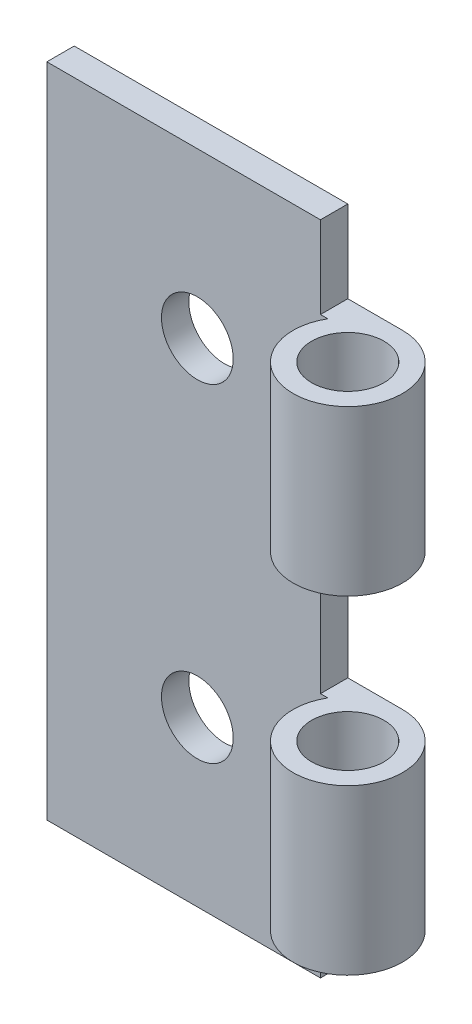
ISO-10303-21;
HEADER;
FILE_DESCRIPTION(('STEP AP214'),'2;1');
FILE_NAME('part.step','',(''),(''),'','','');
FILE_SCHEMA(('AUTOMOTIVE_DESIGN { 1 0 10303 214 1 1 1 1 }'));
ENDSEC;
DATA;
#1=APPLICATION_CONTEXT('core data for automotive mechanical design processes');
#2=APPLICATION_PROTOCOL_DEFINITION('international standard','automotive_design',2000,#1);
#3=PRODUCT_CONTEXT('',#1,'mechanical');
#4=PRODUCT('Part','Part','',(#3));
#5=PRODUCT_RELATED_PRODUCT_CATEGORY('part','',(#4));
#6=PRODUCT_DEFINITION_FORMATION('','',#4);
#7=PRODUCT_DEFINITION_CONTEXT('part definition',#1,'design');
#8=PRODUCT_DEFINITION('design','',#6,#7);
#9=PRODUCT_DEFINITION_SHAPE('','',#8);
#10=(LENGTH_UNIT() NAMED_UNIT(*) SI_UNIT(.MILLI.,.METRE.));
#11=(NAMED_UNIT(*) PLANE_ANGLE_UNIT() SI_UNIT($,.RADIAN.));
#12=(NAMED_UNIT(*) SI_UNIT($,.STERADIAN.) SOLID_ANGLE_UNIT());
#13=UNCERTAINTY_MEASURE_WITH_UNIT(LENGTH_MEASURE(1.E-05),#10,'distance_accuracy_value','');
#14=(GEOMETRIC_REPRESENTATION_CONTEXT(3) GLOBAL_UNCERTAINTY_ASSIGNED_CONTEXT((#13)) GLOBAL_UNIT_ASSIGNED_CONTEXT((#10,
#11,#12)) REPRESENTATION_CONTEXT('',''));
#15=CARTESIAN_POINT('',(0.,0.,0.));
#16=DIRECTION('',(0.,0.,1.));
#17=DIRECTION('',(1.,0.,0.));
#18=AXIS2_PLACEMENT_3D('',#15,#16,#17);
#19=CARTESIAN_POINT('',(0.,76.2,-3.175));
#20=DIRECTION('',(0.,0.,1.));
#21=DIRECTION('',(1.,0.,0.));
#22=AXIS2_PLACEMENT_3D('',#19,#20,#21);
#23=PLANE('',#22);
#24=CARTESIAN_POINT('',(-20.6375,19.05,-3.175));
#25=DIRECTION('',(0.,0.,1.));
#26=DIRECTION('',(1.,0.,0.));
#27=AXIS2_PLACEMENT_3D('',#24,#25,#26);
#28=CIRCLE('',#27,4.1656);
#29=CARTESIAN_POINT('',(-16.4719,19.05,-3.175));
#30=VERTEX_POINT('',#29);
#31=EDGE_CURVE('E194',#30,#30,#28,.T.);
#32=ORIENTED_EDGE('',*,*,#31,.T.);
#33=EDGE_LOOP('',(#32));
#34=FACE_BOUND('',#33,.T.);
#35=CARTESIAN_POINT('',(-20.6375,57.15,-3.175));
#36=DIRECTION('',(0.,0.,1.));
#37=DIRECTION('',(1.,0.,0.));
#38=AXIS2_PLACEMENT_3D('',#35,#36,#37);
#39=CIRCLE('',#38,4.1656);
#40=CARTESIAN_POINT('',(-16.4719,57.15,-3.175));
#41=VERTEX_POINT('',#40);
#42=EDGE_CURVE('E200',#41,#41,#39,.T.);
#43=ORIENTED_EDGE('',*,*,#42,.T.);
#44=EDGE_LOOP('',(#43));
#45=FACE_BOUND('',#44,.T.);
#46=DIRECTION('',(1.,0.,0.));
#47=VECTOR('',#46,1.);
#48=CARTESIAN_POINT('',(0.,47.625,-3.175));
#49=LINE('',#48,#47);
#50=CARTESIAN_POINT('',(-6.35000000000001,47.625,-3.175));
#51=VERTEX_POINT('',#50);
#52=CARTESIAN_POINT('',(0.,47.625,-3.175));
#53=VERTEX_POINT('',#52);
#54=EDGE_CURVE('E134',#51,#53,#49,.T.);
#55=ORIENTED_EDGE('',*,*,#54,.F.);
#56=DIRECTION('',(0.,1.,0.));
#57=VECTOR('',#56,1.);
#58=CARTESIAN_POINT('',(-6.35000000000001,76.2,-3.175));
#59=LINE('',#58,#57);
#60=CARTESIAN_POINT('',(-6.35000000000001,28.575,-3.175));
#61=VERTEX_POINT('',#60);
#62=EDGE_CURVE('E133',#61,#51,#59,.T.);
#63=ORIENTED_EDGE('',*,*,#62,.F.);
#64=DIRECTION('',(-1.,0.,0.));
#65=VECTOR('',#64,1.);
#66=CARTESIAN_POINT('',(0.,28.575,-3.175));
#67=LINE('',#66,#65);
#68=CARTESIAN_POINT('',(0.,28.575,-3.175));
#69=VERTEX_POINT('',#68);
#70=EDGE_CURVE('E141',#69,#61,#67,.T.);
#71=ORIENTED_EDGE('',*,*,#70,.F.);
#72=DIRECTION('',(0.,1.,0.));
#73=VECTOR('',#72,1.);
#74=CARTESIAN_POINT('',(0.,0.,-3.175));
#75=LINE('',#74,#73);
#76=CARTESIAN_POINT('',(0.,9.52499999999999,-3.175));
#77=VERTEX_POINT('',#76);
#78=EDGE_CURVE('E211',#77,#69,#75,.T.);
#79=ORIENTED_EDGE('',*,*,#78,.F.);
#80=DIRECTION('',(-1.,0.,0.));
#81=VECTOR('',#80,1.);
#82=CARTESIAN_POINT('',(0.,9.52499999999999,-3.175));
#83=LINE('',#82,#81);
#84=CARTESIAN_POINT('',(-6.35000000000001,9.52499999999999,-3.175));
#85=VERTEX_POINT('',#84);
#86=EDGE_CURVE('E45',#77,#85,#83,.T.);
#87=ORIENTED_EDGE('',*,*,#86,.T.);
#88=DIRECTION('',(0.,-1.,0.));
#89=VECTOR('',#88,1.);
#90=CARTESIAN_POINT('',(-6.3499999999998,76.2,-3.175));
#91=LINE('',#90,#89);
#92=CARTESIAN_POINT('',(-6.35000000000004,0.,-3.175));
#93=VERTEX_POINT('',#92);
#94=EDGE_CURVE('E163',#85,#93,#91,.T.);
#95=ORIENTED_EDGE('',*,*,#94,.T.);
#96=DIRECTION('',(1.,0.,0.));
#97=VECTOR('',#96,1.);
#98=CARTESIAN_POINT('',(0.,0.,-3.175));
#99=LINE('',#98,#97);
#100=CARTESIAN_POINT('',(-38.1,0.,-3.175));
#101=VERTEX_POINT('',#100);
#102=EDGE_CURVE('E219',#101,#93,#99,.T.);
#103=ORIENTED_EDGE('',*,*,#102,.F.);
#104=DIRECTION('',(0.,-1.,0.));
#105=VECTOR('',#104,1.);
#106=CARTESIAN_POINT('',(-38.1,0.,-3.175));
#107=LINE('',#106,#105);
#108=CARTESIAN_POINT('',(-38.1,76.2,-3.175));
#109=VERTEX_POINT('',#108);
#110=EDGE_CURVE('E216',#109,#101,#107,.T.);
#111=ORIENTED_EDGE('',*,*,#110,.F.);
#112=DIRECTION('',(-1.,0.,0.));
#113=VECTOR('',#112,1.);
#114=CARTESIAN_POINT('',(0.,76.2,-3.175));
#115=LINE('',#114,#113);
#116=CARTESIAN_POINT('',(-6.34999999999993,76.2,-3.175));
#117=VERTEX_POINT('',#116);
#118=EDGE_CURVE('E214',#117,#109,#115,.T.);
#119=ORIENTED_EDGE('',*,*,#118,.F.);
#120=DIRECTION('',(0.,1.,0.));
#121=VECTOR('',#120,1.);
#122=CARTESIAN_POINT('',(-6.34999999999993,76.2000000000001,-3.175));
#123=LINE('',#122,#121);
#124=CARTESIAN_POINT('',(-6.35000000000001,66.675,-3.175));
#125=VERTEX_POINT('',#124);
#126=EDGE_CURVE('E189',#125,#117,#123,.T.);
#127=ORIENTED_EDGE('',*,*,#126,.F.);
#128=DIRECTION('',(-1.,0.,0.));
#129=VECTOR('',#128,1.);
#130=CARTESIAN_POINT('',(0.,66.675,-3.175));
#131=LINE('',#130,#129);
#132=CARTESIAN_POINT('',(0.,66.675,-3.175));
#133=VERTEX_POINT('',#132);
#134=EDGE_CURVE('E184',#133,#125,#131,.T.);
#135=ORIENTED_EDGE('',*,*,#134,.F.);
#136=EDGE_CURVE('E210',#53,#133,#75,.T.);
#137=ORIENTED_EDGE('',*,*,#136,.F.);
#138=EDGE_LOOP('',(#55,#63,#71,#79,#87,#95,#103,#111,#119,#127,#135,#137));
#139=FACE_BOUND('',#138,.T.);
#140=ADVANCED_FACE('F30',(#34,#45,#139),#23,.F.);
#141=CARTESIAN_POINT('',(0.,76.2,0.));
#142=DIRECTION('',(0.,0.,1.));
#143=DIRECTION('',(1.,0.,0.));
#144=AXIS2_PLACEMENT_3D('',#141,#142,#143);
#145=PLANE('',#144);
#146=CARTESIAN_POINT('',(-20.6375,19.05,0.));
#147=DIRECTION('',(0.,0.,1.));
#148=DIRECTION('',(1.,0.,0.));
#149=AXIS2_PLACEMENT_3D('',#146,#147,#148);
#150=CIRCLE('',#149,4.1656);
#151=CARTESIAN_POINT('',(-16.4719,19.05,0.));
#152=VERTEX_POINT('',#151);
#153=EDGE_CURVE('E191',#152,#152,#150,.T.);
#154=ORIENTED_EDGE('',*,*,#153,.F.);
#155=EDGE_LOOP('',(#154));
#156=FACE_BOUND('',#155,.T.);
#157=CARTESIAN_POINT('',(-20.6375,57.15,0.));
#158=DIRECTION('',(0.,0.,1.));
#159=DIRECTION('',(1.,0.,0.));
#160=AXIS2_PLACEMENT_3D('',#157,#158,#159);
#161=CIRCLE('',#160,4.1656);
#162=CARTESIAN_POINT('',(-16.4719,57.15,0.));
#163=VERTEX_POINT('',#162);
#164=EDGE_CURVE('E197',#163,#163,#161,.T.);
#165=ORIENTED_EDGE('',*,*,#164,.F.);
#166=EDGE_LOOP('',(#165));
#167=FACE_BOUND('',#166,.T.);
#168=DIRECTION('',(0.,1.,0.));
#169=VECTOR('',#168,1.);
#170=CARTESIAN_POINT('',(-6.35000000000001,76.2,0.));
#171=LINE('',#170,#169);
#172=CARTESIAN_POINT('',(-6.35000000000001,28.575,0.));
#173=VERTEX_POINT('',#172);
#174=CARTESIAN_POINT('',(-6.35000000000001,47.625,0.));
#175=VERTEX_POINT('',#174);
#176=EDGE_CURVE('E124',#173,#175,#171,.T.);
#177=ORIENTED_EDGE('',*,*,#176,.T.);
#178=DIRECTION('',(1.,0.,0.));
#179=VECTOR('',#178,1.);
#180=CARTESIAN_POINT('',(0.,47.625,0.));
#181=LINE('',#180,#179);
#182=CARTESIAN_POINT('',(-5.49926131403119,47.625,0.));
#183=VERTEX_POINT('',#182);
#184=EDGE_CURVE('E154',#175,#183,#181,.T.);
#185=ORIENTED_EDGE('',*,*,#184,.T.);
#186=DIRECTION('',(0.,-1.,0.));
#187=VECTOR('',#186,1.);
#188=CARTESIAN_POINT('',(-5.49926131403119,76.2,0.));
#189=LINE('',#188,#187);
#190=CARTESIAN_POINT('',(-5.49926131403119,66.675,0.));
#191=VERTEX_POINT('',#190);
#192=EDGE_CURVE('E226',#191,#183,#189,.T.);
#193=ORIENTED_EDGE('',*,*,#192,.F.);
#194=DIRECTION('',(-1.,0.,0.));
#195=VECTOR('',#194,1.);
#196=CARTESIAN_POINT('',(0.,66.675,0.));
#197=LINE('',#196,#195);
#198=CARTESIAN_POINT('',(-6.35000000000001,66.675,0.));
#199=VERTEX_POINT('',#198);
#200=EDGE_CURVE('E181',#191,#199,#197,.T.);
#201=ORIENTED_EDGE('',*,*,#200,.T.);
#202=DIRECTION('',(0.,1.,0.));
#203=VECTOR('',#202,1.);
#204=CARTESIAN_POINT('',(-6.34999999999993,76.2000000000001,0.));
#205=LINE('',#204,#203);
#206=CARTESIAN_POINT('',(-6.34999999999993,76.2,0.));
#207=VERTEX_POINT('',#206);
#208=EDGE_CURVE('E186',#199,#207,#205,.T.);
#209=ORIENTED_EDGE('',*,*,#208,.T.);
#210=DIRECTION('',(-1.,0.,0.));
#211=VECTOR('',#210,1.);
#212=CARTESIAN_POINT('',(0.,76.2,0.));
#213=LINE('',#212,#211);
#214=CARTESIAN_POINT('',(-38.1,76.2,0.));
#215=VERTEX_POINT('',#214);
#216=EDGE_CURVE('E203',#207,#215,#213,.T.);
#217=ORIENTED_EDGE('',*,*,#216,.T.);
#218=DIRECTION('',(0.,-1.,0.));
#219=VECTOR('',#218,1.);
#220=CARTESIAN_POINT('',(-38.1,0.,0.));
#221=LINE('',#220,#219);
#222=CARTESIAN_POINT('',(-38.1,0.,0.));
#223=VERTEX_POINT('',#222);
#224=EDGE_CURVE('E205',#215,#223,#221,.T.);
#225=ORIENTED_EDGE('',*,*,#224,.T.);
#226=DIRECTION('',(1.,0.,0.));
#227=VECTOR('',#226,1.);
#228=CARTESIAN_POINT('',(0.,0.,0.));
#229=LINE('',#228,#227);
#230=CARTESIAN_POINT('',(-6.35000000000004,0.,0.));
#231=VERTEX_POINT('',#230);
#232=EDGE_CURVE('E208',#223,#231,#229,.T.);
#233=ORIENTED_EDGE('',*,*,#232,.T.);
#234=DIRECTION('',(0.,-1.,0.));
#235=VECTOR('',#234,1.);
#236=CARTESIAN_POINT('',(-6.3499999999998,76.2,0.));
#237=LINE('',#236,#235);
#238=CARTESIAN_POINT('',(-6.35000000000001,9.52499999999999,0.));
#239=VERTEX_POINT('',#238);
#240=EDGE_CURVE('E53',#239,#231,#237,.T.);
#241=ORIENTED_EDGE('',*,*,#240,.F.);
#242=DIRECTION('',(-1.,0.,0.));
#243=VECTOR('',#242,1.);
#244=CARTESIAN_POINT('',(0.,9.52499999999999,0.));
#245=LINE('',#244,#243);
#246=CARTESIAN_POINT('',(-5.49926131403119,9.52500000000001,0.));
#247=VERTEX_POINT('',#246);
#248=EDGE_CURVE('E169',#247,#239,#245,.T.);
#249=ORIENTED_EDGE('',*,*,#248,.F.);
#250=CARTESIAN_POINT('',(-5.49926131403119,28.575,0.));
#251=VERTEX_POINT('',#250);
#252=EDGE_CURVE('E145',#251,#247,#189,.T.);
#253=ORIENTED_EDGE('',*,*,#252,.F.);
#254=DIRECTION('',(-1.,0.,0.));
#255=VECTOR('',#254,1.);
#256=CARTESIAN_POINT('',(0.,28.575,0.));
#257=LINE('',#256,#255);
#258=EDGE_CURVE('E138',#251,#173,#257,.T.);
#259=ORIENTED_EDGE('',*,*,#258,.T.);
#260=EDGE_LOOP('',(#177,#185,#193,#201,#209,#217,#225,#233,#241,#249,#253,#259));
#261=FACE_BOUND('',#260,.T.);
#262=ADVANCED_FACE('F144',(#156,#167,#261),#145,.T.);
#263=CARTESIAN_POINT('',(0.,76.2,3.175));
#264=DIRECTION('',(0.,-1.,0.));
#265=DIRECTION('',(1.,0.,0.));
#266=AXIS2_PLACEMENT_3D('',#263,#264,#265);
#267=CYLINDRICAL_SURFACE('',#266,6.35);
#268=CARTESIAN_POINT('',(0.,47.625,3.175));
#269=DIRECTION('',(0.,-1.,0.));
#270=DIRECTION('',(0.,0.,-1.));
#271=AXIS2_PLACEMENT_3D('',#268,#269,#270);
#272=CIRCLE('',#271,6.35);
#273=EDGE_CURVE('E148',#183,#53,#272,.F.);
#274=ORIENTED_EDGE('',*,*,#273,.T.);
#275=ORIENTED_EDGE('',*,*,#136,.T.);
#276=CARTESIAN_POINT('',(0.,66.675,3.175));
#277=DIRECTION('',(0.,1.,0.));
#278=DIRECTION('',(0.,0.,1.));
#279=AXIS2_PLACEMENT_3D('',#276,#277,#278);
#280=CIRCLE('',#279,6.35);
#281=EDGE_CURVE('E178',#133,#191,#280,.F.);
#282=ORIENTED_EDGE('',*,*,#281,.T.);
#283=ORIENTED_EDGE('',*,*,#192,.T.);
#284=EDGE_LOOP('',(#274,#275,#282,#283));
#285=FACE_BOUND('',#284,.T.);
#286=ADVANCED_FACE('F261',(#285),#267,.T.);
#287=ORIENTED_EDGE('',*,*,#78,.T.);
#288=CARTESIAN_POINT('',(0.,28.575,3.175));
#289=DIRECTION('',(0.,1.,0.));
#290=DIRECTION('',(-1.,0.,0.));
#291=AXIS2_PLACEMENT_3D('',#288,#289,#290);
#292=CIRCLE('',#291,6.35);
#293=EDGE_CURVE('E146',#69,#251,#292,.F.);
#294=ORIENTED_EDGE('',*,*,#293,.T.);
#295=ORIENTED_EDGE('',*,*,#252,.T.);
#296=CARTESIAN_POINT('',(0.,9.52499999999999,3.175));
#297=DIRECTION('',(0.,1.,0.));
#298=DIRECTION('',(0.,0.,1.));
#299=AXIS2_PLACEMENT_3D('',#296,#297,#298);
#300=CIRCLE('',#299,6.35);
#301=EDGE_CURVE('E166',#77,#247,#300,.F.);
#302=ORIENTED_EDGE('',*,*,#301,.F.);
#303=EDGE_LOOP('',(#287,#294,#295,#302));
#304=FACE_BOUND('',#303,.T.);
#305=ADVANCED_FACE('F251',(#304),#267,.T.);
#306=CARTESIAN_POINT('',(0.,76.2,3.175));
#307=DIRECTION('',(0.,-1.,0.));
#308=DIRECTION('',(1.,0.,0.));
#309=AXIS2_PLACEMENT_3D('',#306,#307,#308);
#310=CYLINDRICAL_SURFACE('',#309,4.191);
#311=CARTESIAN_POINT('',(0.,66.675,3.175));
#312=DIRECTION('',(0.,1.,0.));
#313=DIRECTION('',(0.,0.,1.));
#314=AXIS2_PLACEMENT_3D('',#311,#312,#313);
#315=CIRCLE('',#314,4.191);
#316=CARTESIAN_POINT('',(4.19099999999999,66.675,3.175));
#317=VERTEX_POINT('',#316);
#318=EDGE_CURVE('E229',#317,#317,#315,.F.);
#319=CARTESIAN_POINT('',(0.,47.625,3.175));
#320=DIRECTION('',(0.,-1.,0.));
#321=DIRECTION('',(0.,0.,-1.));
#322=AXIS2_PLACEMENT_3D('',#319,#320,#321);
#323=CIRCLE('',#322,4.191);
#324=CARTESIAN_POINT('',(4.191,47.625,3.175));
#325=VERTEX_POINT('',#324);
#326=EDGE_CURVE('E11',#325,#325,#323,.F.);
#327=CARTESIAN_POINT('',(4.19099999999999,66.675,3.175));
#328=CARTESIAN_POINT('',(4.19099999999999,66.4765625,3.175));
#329=CARTESIAN_POINT('',(4.19099999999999,66.278125,3.175));
#330=CARTESIAN_POINT('',(4.19099999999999,65.88125,3.175));
#331=CARTESIAN_POINT('',(4.19099999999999,65.6828125,3.175));
#332=CARTESIAN_POINT('',(4.19099999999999,65.2859375,3.175));
#333=CARTESIAN_POINT('',(4.19099999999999,65.0875,3.175));
#334=CARTESIAN_POINT('',(4.19099999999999,64.690625,3.175));
#335=CARTESIAN_POINT('',(4.19099999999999,64.4921875,3.175));
#336=CARTESIAN_POINT('',(4.19099999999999,64.0953125,3.175));
#337=CARTESIAN_POINT('',(4.19099999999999,63.896875,3.175));
#338=CARTESIAN_POINT('',(4.19099999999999,63.5,3.175));
#339=CARTESIAN_POINT('',(4.19099999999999,63.3015625,3.175));
#340=CARTESIAN_POINT('',(4.19099999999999,62.9046875,3.175));
#341=CARTESIAN_POINT('',(4.19099999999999,62.70625,3.175));
#342=CARTESIAN_POINT('',(4.19099999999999,62.309375,3.175));
#343=CARTESIAN_POINT('',(4.19099999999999,62.1109375,3.175));
#344=CARTESIAN_POINT('',(4.19099999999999,61.7140625,3.175));
#345=CARTESIAN_POINT('',(4.19099999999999,61.515625,3.175));
#346=CARTESIAN_POINT('',(4.19099999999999,61.11875,3.175));
#347=CARTESIAN_POINT('',(4.19099999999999,60.9203125,3.175));
#348=CARTESIAN_POINT('',(4.19099999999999,60.5234375,3.175));
#349=CARTESIAN_POINT('',(4.19099999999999,60.325,3.175));
#350=CARTESIAN_POINT('',(4.19099999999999,59.928125,3.175));
#351=CARTESIAN_POINT('',(4.19099999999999,59.7296875,3.175));
#352=CARTESIAN_POINT('',(4.19099999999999,59.3328125,3.175));
#353=CARTESIAN_POINT('',(4.19099999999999,59.134375,3.175));
#354=CARTESIAN_POINT('',(4.19099999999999,58.7375,3.175));
#355=CARTESIAN_POINT('',(4.19099999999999,58.5390625,3.175));
#356=CARTESIAN_POINT('',(4.19099999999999,58.1421875,3.175));
#357=CARTESIAN_POINT('',(4.19099999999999,57.94375,3.175));
#358=CARTESIAN_POINT('',(4.19099999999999,57.546875,3.175));
#359=CARTESIAN_POINT('',(4.19099999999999,57.3484375,3.175));
#360=CARTESIAN_POINT('',(4.19099999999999,56.9515625,3.175));
#361=CARTESIAN_POINT('',(4.19099999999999,56.753125,3.175));
#362=CARTESIAN_POINT('',(4.19099999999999,56.35625,3.175));
#363=CARTESIAN_POINT('',(4.19099999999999,56.1578125,3.175));
#364=CARTESIAN_POINT('',(4.19099999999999,55.7609375,3.175));
#365=CARTESIAN_POINT('',(4.19099999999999,55.5625,3.175));
#366=CARTESIAN_POINT('',(4.19099999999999,55.165625,3.175));
#367=CARTESIAN_POINT('',(4.19099999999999,54.9671875,3.175));
#368=CARTESIAN_POINT('',(4.19099999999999,54.5703125,3.175));
#369=CARTESIAN_POINT('',(4.19099999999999,54.371875,3.175));
#370=CARTESIAN_POINT('',(4.19099999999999,53.975,3.175));
#371=CARTESIAN_POINT('',(4.19099999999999,53.7765625,3.175));
#372=CARTESIAN_POINT('',(4.19099999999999,53.3796875,3.175));
#373=CARTESIAN_POINT('',(4.19099999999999,53.18125,3.175));
#374=CARTESIAN_POINT('',(4.19099999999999,52.784375,3.175));
#375=CARTESIAN_POINT('',(4.19099999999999,52.5859375,3.175));
#376=CARTESIAN_POINT('',(4.19099999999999,52.1890625,3.175));
#377=CARTESIAN_POINT('',(4.19099999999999,51.990625,3.175));
#378=CARTESIAN_POINT('',(4.19099999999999,51.59375,3.175));
#379=CARTESIAN_POINT('',(4.191,51.3953125,3.175));
#380=CARTESIAN_POINT('',(4.191,50.9984375,3.175));
#381=CARTESIAN_POINT('',(4.191,50.8,3.175));
#382=CARTESIAN_POINT('',(4.191,50.403125,3.175));
#383=CARTESIAN_POINT('',(4.191,50.2046875,3.175));
#384=CARTESIAN_POINT('',(4.191,49.8078125,3.175));
#385=CARTESIAN_POINT('',(4.191,49.609375,3.175));
#386=CARTESIAN_POINT('',(4.191,49.2125,3.175));
#387=CARTESIAN_POINT('',(4.191,49.0140625,3.175));
#388=CARTESIAN_POINT('',(4.191,48.6171875,3.175));
#389=CARTESIAN_POINT('',(4.191,48.41875,3.175));
#390=CARTESIAN_POINT('',(4.191,48.021875,3.175));
#391=CARTESIAN_POINT('',(4.191,47.8234375,3.175));
#392=CARTESIAN_POINT('',(4.191,47.625,3.175));
#393=B_SPLINE_CURVE_WITH_KNOTS('',3,(#327,#328,#329,#330,#331,#332,#333,#334,#335,#336,#337,
#338,#339,#340,#341,#342,#343,#344,#345,#346,#347,#348,#349,#350,#351,#352,#353,#354,#355,#356,
#357,#358,#359,#360,#361,#362,#363,#364,#365,#366,#367,#368,#369,#370,#371,#372,#373,#374,#375,
#376,#377,#378,#379,#380,#381,#382,#383,#384,#385,#386,#387,#388,#389,#390,#391,#392),
.UNSPECIFIED.,.F.,.F.,(4,2,2,2,2,2,2,2,2,2,2,2,2,2,2,2,2,2,2,2,2,2,2,2,2,2,2,2,2,2,2,2,4),(0.,
0.5953125,1.190625,1.7859375,2.38125,2.9765625,3.571875,4.1671875,4.7625,5.3578125,5.953125,
6.5484375,7.14375,7.7390625,8.334375,8.9296875,9.525,10.1203125,10.715625,11.3109375,11.90625,
12.5015625,13.096875,13.6921875,14.2875,14.8828125,15.478125,16.0734375,16.66875,17.2640625,
17.859375,18.4546875,19.05),.UNSPECIFIED.);
#394=EDGE_CURVE('BSEAM242',#317,#325,#393,.T.);
#395=ORIENTED_EDGE('',*,*,#318,.F.);
#396=ORIENTED_EDGE('',*,*,#326,.F.);
#397=ORIENTED_EDGE('',*,*,#394,.T.);
#398=ORIENTED_EDGE('',*,*,#394,.F.);
#399=EDGE_LOOP('',(#395,#397,#396,#398));
#400=FACE_BOUND('',#399,.T.);
#401=ADVANCED_FACE('F242',(#400),#310,.F.);
#402=CARTESIAN_POINT('',(0.,9.52499999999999,3.175));
#403=DIRECTION('',(0.,1.,0.));
#404=DIRECTION('',(0.,0.,1.));
#405=AXIS2_PLACEMENT_3D('',#402,#403,#404);
#406=CIRCLE('',#405,4.191);
#407=CARTESIAN_POINT('',(4.191,9.52499999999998,3.175));
#408=VERTEX_POINT('',#407);
#409=EDGE_CURVE('E165',#408,#408,#406,.F.);
#410=CARTESIAN_POINT('',(0.,28.575,3.175));
#411=DIRECTION('',(0.,1.,0.));
#412=DIRECTION('',(-1.,0.,0.));
#413=AXIS2_PLACEMENT_3D('',#410,#411,#412);
#414=CIRCLE('',#413,4.191);
#415=CARTESIAN_POINT('',(4.191,28.575,3.175));
#416=VERTEX_POINT('',#415);
#417=EDGE_CURVE('E38',#416,#416,#414,.F.);
#418=CARTESIAN_POINT('',(4.191,9.52499999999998,3.175));
#419=CARTESIAN_POINT('',(4.191,9.72343749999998,3.175));
#420=CARTESIAN_POINT('',(4.191,9.92187499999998,3.175));
#421=CARTESIAN_POINT('',(4.191,10.31875,3.175));
#422=CARTESIAN_POINT('',(4.191,10.5171875,3.175));
#423=CARTESIAN_POINT('',(4.191,10.9140625,3.175));
#424=CARTESIAN_POINT('',(4.191,11.1125,3.175));
#425=CARTESIAN_POINT('',(4.191,11.509375,3.175));
#426=CARTESIAN_POINT('',(4.191,11.7078125,3.175));
#427=CARTESIAN_POINT('',(4.191,12.1046875,3.175));
#428=CARTESIAN_POINT('',(4.191,12.303125,3.175));
#429=CARTESIAN_POINT('',(4.191,12.7,3.175));
#430=CARTESIAN_POINT('',(4.191,12.8984375,3.175));
#431=CARTESIAN_POINT('',(4.191,13.2953125,3.175));
#432=CARTESIAN_POINT('',(4.191,13.49375,3.175));
#433=CARTESIAN_POINT('',(4.191,13.890625,3.175));
#434=CARTESIAN_POINT('',(4.191,14.0890625,3.175));
#435=CARTESIAN_POINT('',(4.191,14.4859375,3.175));
#436=CARTESIAN_POINT('',(4.191,14.684375,3.175));
#437=CARTESIAN_POINT('',(4.191,15.08125,3.175));
#438=CARTESIAN_POINT('',(4.191,15.2796875,3.175));
#439=CARTESIAN_POINT('',(4.191,15.6765625,3.175));
#440=CARTESIAN_POINT('',(4.191,15.875,3.175));
#441=CARTESIAN_POINT('',(4.191,16.271875,3.175));
#442=CARTESIAN_POINT('',(4.191,16.4703125,3.175));
#443=CARTESIAN_POINT('',(4.191,16.8671875,3.175));
#444=CARTESIAN_POINT('',(4.191,17.065625,3.175));
#445=CARTESIAN_POINT('',(4.191,17.4625,3.175));
#446=CARTESIAN_POINT('',(4.191,17.6609375,3.175));
#447=CARTESIAN_POINT('',(4.191,18.0578125,3.175));
#448=CARTESIAN_POINT('',(4.191,18.25625,3.175));
#449=CARTESIAN_POINT('',(4.191,18.653125,3.175));
#450=CARTESIAN_POINT('',(4.191,18.8515625,3.175));
#451=CARTESIAN_POINT('',(4.191,19.2484375,3.175));
#452=CARTESIAN_POINT('',(4.191,19.446875,3.175));
#453=CARTESIAN_POINT('',(4.191,19.84375,3.175));
#454=CARTESIAN_POINT('',(4.191,20.0421875,3.175));
#455=CARTESIAN_POINT('',(4.191,20.4390625,3.175));
#456=CARTESIAN_POINT('',(4.191,20.6375,3.175));
#457=CARTESIAN_POINT('',(4.191,21.034375,3.175));
#458=CARTESIAN_POINT('',(4.191,21.2328125,3.175));
#459=CARTESIAN_POINT('',(4.191,21.6296875,3.175));
#460=CARTESIAN_POINT('',(4.191,21.828125,3.175));
#461=CARTESIAN_POINT('',(4.191,22.225,3.175));
#462=CARTESIAN_POINT('',(4.191,22.4234375,3.175));
#463=CARTESIAN_POINT('',(4.191,22.8203125,3.175));
#464=CARTESIAN_POINT('',(4.191,23.01875,3.175));
#465=CARTESIAN_POINT('',(4.191,23.415625,3.175));
#466=CARTESIAN_POINT('',(4.191,23.6140625,3.175));
#467=CARTESIAN_POINT('',(4.191,24.0109375,3.175));
#468=CARTESIAN_POINT('',(4.191,24.209375,3.175));
#469=CARTESIAN_POINT('',(4.191,24.60625,3.175));
#470=CARTESIAN_POINT('',(4.191,24.8046875,3.175));
#471=CARTESIAN_POINT('',(4.191,25.2015625,3.175));
#472=CARTESIAN_POINT('',(4.191,25.4,3.175));
#473=CARTESIAN_POINT('',(4.191,25.796875,3.175));
#474=CARTESIAN_POINT('',(4.191,25.9953125,3.175));
#475=CARTESIAN_POINT('',(4.191,26.3921875,3.175));
#476=CARTESIAN_POINT('',(4.191,26.590625,3.175));
#477=CARTESIAN_POINT('',(4.191,26.9875,3.175));
#478=CARTESIAN_POINT('',(4.191,27.1859375,3.175));
#479=CARTESIAN_POINT('',(4.191,27.5828125,3.175));
#480=CARTESIAN_POINT('',(4.191,27.78125,3.175));
#481=CARTESIAN_POINT('',(4.191,28.178125,3.175));
#482=CARTESIAN_POINT('',(4.191,28.3765625,3.175));
#483=CARTESIAN_POINT('',(4.191,28.575,3.175));
#484=B_SPLINE_CURVE_WITH_KNOTS('',3,(#418,#419,#420,#421,#422,#423,#424,#425,#426,#427,#428,
#429,#430,#431,#432,#433,#434,#435,#436,#437,#438,#439,#440,#441,#442,#443,#444,#445,#446,#447,
#448,#449,#450,#451,#452,#453,#454,#455,#456,#457,#458,#459,#460,#461,#462,#463,#464,#465,#466,
#467,#468,#469,#470,#471,#472,#473,#474,#475,#476,#477,#478,#479,#480,#481,#482,#483),
.UNSPECIFIED.,.F.,.F.,(4,2,2,2,2,2,2,2,2,2,2,2,2,2,2,2,2,2,2,2,2,2,2,2,2,2,2,2,2,2,2,2,4),(0.,
0.5953125,1.190625,1.7859375,2.38125,2.9765625,3.571875,4.1671875,4.7625,5.3578125,5.953125,
6.5484375,7.14375,7.7390625,8.334375,8.92968750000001,9.52500000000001,10.1203125,10.715625,
11.3109375,11.90625,12.5015625,13.096875,13.6921875,14.2875,14.8828125,15.478125,16.0734375,
16.66875,17.2640625,17.859375,18.4546875,19.05),.UNSPECIFIED.);
#485=EDGE_CURVE('BSEAM240',#408,#416,#484,.T.);
#486=ORIENTED_EDGE('',*,*,#409,.T.);
#487=ORIENTED_EDGE('',*,*,#417,.F.);
#488=ORIENTED_EDGE('',*,*,#485,.T.);
#489=ORIENTED_EDGE('',*,*,#485,.F.);
#490=EDGE_LOOP('',(#486,#488,#487,#489));
#491=FACE_BOUND('',#490,.T.);
#492=ADVANCED_FACE('F240',(#491),#310,.F.);
#493=CARTESIAN_POINT('',(0.,76.2,-3.175));
#494=DIRECTION('',(0.,1.,0.));
#495=DIRECTION('',(0.,0.,1.));
#496=AXIS2_PLACEMENT_3D('',#493,#494,#495);
#497=PLANE('',#496);
#498=ORIENTED_EDGE('',*,*,#216,.F.);
#499=DIRECTION('',(0.,0.,-1.));
#500=VECTOR('',#499,1.);
#501=CARTESIAN_POINT('',(-6.34999999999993,76.2,115.376871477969));
#502=LINE('',#501,#500);
#503=EDGE_CURVE('E175',#207,#117,#502,.T.);
#504=ORIENTED_EDGE('',*,*,#503,.T.);
#505=ORIENTED_EDGE('',*,*,#118,.T.);
#506=DIRECTION('',(0.,0.,1.));
#507=VECTOR('',#506,1.);
#508=CARTESIAN_POINT('',(-38.1,76.2,-3.175));
#509=LINE('',#508,#507);
#510=EDGE_CURVE('E221',#109,#215,#509,.T.);
#511=ORIENTED_EDGE('',*,*,#510,.T.);
#512=EDGE_LOOP('',(#498,#504,#505,#511));
#513=FACE_BOUND('',#512,.T.);
#514=ADVANCED_FACE('F32',(#513),#497,.T.);
#515=CARTESIAN_POINT('',(0.,0.,-3.175));
#516=DIRECTION('',(0.,-1.,0.));
#517=DIRECTION('',(1.,0.,0.));
#518=AXIS2_PLACEMENT_3D('',#515,#516,#517);
#519=PLANE('',#518);
#520=DIRECTION('',(0.,0.,-1.));
#521=VECTOR('',#520,1.);
#522=CARTESIAN_POINT('',(-6.35000000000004,0.,-3.175));
#523=LINE('',#522,#521);
#524=EDGE_CURVE('E232',#231,#93,#523,.T.);
#525=ORIENTED_EDGE('',*,*,#524,.F.);
#526=ORIENTED_EDGE('',*,*,#232,.F.);
#527=DIRECTION('',(0.,0.,1.));
#528=VECTOR('',#527,1.);
#529=CARTESIAN_POINT('',(-38.1,0.,-3.175));
#530=LINE('',#529,#528);
#531=EDGE_CURVE('E222',#101,#223,#530,.T.);
#532=ORIENTED_EDGE('',*,*,#531,.F.);
#533=ORIENTED_EDGE('',*,*,#102,.T.);
#534=EDGE_LOOP('',(#525,#526,#532,#533));
#535=FACE_BOUND('',#534,.T.);
#536=ADVANCED_FACE('F249',(#535),#519,.T.);
#537=CARTESIAN_POINT('',(-38.1,0.,-3.175));
#538=DIRECTION('',(-1.,0.,0.));
#539=DIRECTION('',(0.,0.,1.));
#540=AXIS2_PLACEMENT_3D('',#537,#538,#539);
#541=PLANE('',#540);
#542=ORIENTED_EDGE('',*,*,#224,.F.);
#543=ORIENTED_EDGE('',*,*,#510,.F.);
#544=ORIENTED_EDGE('',*,*,#110,.T.);
#545=ORIENTED_EDGE('',*,*,#531,.T.);
#546=EDGE_LOOP('',(#542,#543,#544,#545));
#547=FACE_BOUND('',#546,.T.);
#548=ADVANCED_FACE('F268',(#547),#541,.T.);
#549=CARTESIAN_POINT('',(-20.6375,57.15,-3.175));
#550=DIRECTION('',(0.,0.,1.));
#551=DIRECTION('',(1.,0.,0.));
#552=AXIS2_PLACEMENT_3D('',#549,#550,#551);
#553=CYLINDRICAL_SURFACE('',#552,4.1656);
#554=ORIENTED_EDGE('',*,*,#42,.F.);
#555=EDGE_LOOP('',(#554));
#556=FACE_BOUND('',#555,.T.);
#557=ORIENTED_EDGE('',*,*,#164,.T.);
#558=EDGE_LOOP('',(#557));
#559=FACE_BOUND('',#558,.T.);
#560=ADVANCED_FACE('F271',(#556,#559),#553,.F.);
#561=CARTESIAN_POINT('',(-20.6375,19.05,-3.175));
#562=DIRECTION('',(0.,0.,1.));
#563=DIRECTION('',(1.,0.,0.));
#564=AXIS2_PLACEMENT_3D('',#561,#562,#563);
#565=CYLINDRICAL_SURFACE('',#564,4.1656);
#566=ORIENTED_EDGE('',*,*,#31,.F.);
#567=EDGE_LOOP('',(#566));
#568=FACE_BOUND('',#567,.T.);
#569=ORIENTED_EDGE('',*,*,#153,.T.);
#570=EDGE_LOOP('',(#569));
#571=FACE_BOUND('',#570,.T.);
#572=ADVANCED_FACE('F276',(#568,#571),#565,.F.);
#573=CARTESIAN_POINT('',(-6.34999999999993,76.2,115.376871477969));
#574=DIRECTION('',(1.,0.,0.));
#575=DIRECTION('',(0.,1.,0.));
#576=AXIS2_PLACEMENT_3D('',#573,#574,#575);
#577=PLANE('',#576);
#578=DIRECTION('',(0.,0.,-1.));
#579=VECTOR('',#578,1.);
#580=CARTESIAN_POINT('',(-6.35000000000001,66.675,115.376871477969));
#581=LINE('',#580,#579);
#582=EDGE_CURVE('E172',#199,#125,#581,.T.);
#583=ORIENTED_EDGE('',*,*,#582,.T.);
#584=ORIENTED_EDGE('',*,*,#126,.T.);
#585=ORIENTED_EDGE('',*,*,#503,.F.);
#586=ORIENTED_EDGE('',*,*,#208,.F.);
#587=EDGE_LOOP('',(#583,#584,#585,#586));
#588=FACE_BOUND('',#587,.T.);
#589=ADVANCED_FACE('F304',(#588),#577,.T.);
#590=CARTESIAN_POINT('',(-6.35000000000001,66.675,115.376871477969));
#591=DIRECTION('',(0.,1.,0.));
#592=DIRECTION('',(0.,0.,1.));
#593=AXIS2_PLACEMENT_3D('',#590,#591,#592);
#594=PLANE('',#593);
#595=ORIENTED_EDGE('',*,*,#318,.T.);
#596=EDGE_LOOP('',(#595));
#597=FACE_BOUND('',#596,.T.);
#598=ORIENTED_EDGE('',*,*,#281,.F.);
#599=ORIENTED_EDGE('',*,*,#134,.T.);
#600=ORIENTED_EDGE('',*,*,#582,.F.);
#601=ORIENTED_EDGE('',*,*,#200,.F.);
#602=EDGE_LOOP('',(#598,#599,#600,#601));
#603=FACE_BOUND('',#602,.T.);
#604=ADVANCED_FACE('F299',(#597,#603),#594,.T.);
#605=CARTESIAN_POINT('',(-6.35000000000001,9.525,111.408121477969));
#606=DIRECTION('',(0.,1.,0.));
#607=DIRECTION('',(0.,0.,1.));
#608=AXIS2_PLACEMENT_3D('',#605,#606,#607);
#609=PLANE('',#608);
#610=ORIENTED_EDGE('',*,*,#409,.F.);
#611=EDGE_LOOP('',(#610));
#612=FACE_BOUND('',#611,.T.);
#613=ORIENTED_EDGE('',*,*,#86,.F.);
#614=ORIENTED_EDGE('',*,*,#301,.T.);
#615=ORIENTED_EDGE('',*,*,#248,.T.);
#616=DIRECTION('',(0.,0.,-1.));
#617=VECTOR('',#616,1.);
#618=CARTESIAN_POINT('',(-6.35000000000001,9.525,111.408121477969));
#619=LINE('',#618,#617);
#620=EDGE_CURVE('E159',#239,#85,#619,.T.);
#621=ORIENTED_EDGE('',*,*,#620,.T.);
#622=EDGE_LOOP('',(#613,#614,#615,#621));
#623=FACE_BOUND('',#622,.T.);
#624=ADVANCED_FACE('F288',(#612,#623),#609,.F.);
#625=CARTESIAN_POINT('',(-6.35000000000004,0.,111.408121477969));
#626=DIRECTION('',(-1.,0.,0.));
#627=DIRECTION('',(0.,-1.,0.));
#628=AXIS2_PLACEMENT_3D('',#625,#626,#627);
#629=PLANE('',#628);
#630=ORIENTED_EDGE('',*,*,#94,.F.);
#631=ORIENTED_EDGE('',*,*,#620,.F.);
#632=ORIENTED_EDGE('',*,*,#240,.T.);
#633=ORIENTED_EDGE('',*,*,#524,.T.);
#634=EDGE_LOOP('',(#630,#631,#632,#633));
#635=FACE_BOUND('',#634,.T.);
#636=ADVANCED_FACE('F285',(#635),#629,.F.);
#637=CARTESIAN_POINT('',(-6.35000000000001,47.625,111.408121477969));
#638=DIRECTION('',(1.,0.,0.));
#639=DIRECTION('',(0.,0.,-1.));
#640=AXIS2_PLACEMENT_3D('',#637,#638,#639);
#641=PLANE('',#640);
#642=DIRECTION('',(0.,0.,-1.));
#643=VECTOR('',#642,1.);
#644=CARTESIAN_POINT('',(-6.35000000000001,28.575,111.408121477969));
#645=LINE('',#644,#643);
#646=EDGE_CURVE('E127',#173,#61,#645,.T.);
#647=ORIENTED_EDGE('',*,*,#646,.T.);
#648=ORIENTED_EDGE('',*,*,#62,.T.);
#649=DIRECTION('',(0.,0.,-1.));
#650=VECTOR('',#649,1.);
#651=CARTESIAN_POINT('',(-6.35000000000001,47.625,111.408121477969));
#652=LINE('',#651,#650);
#653=EDGE_CURVE('E130',#175,#51,#652,.T.);
#654=ORIENTED_EDGE('',*,*,#653,.F.);
#655=ORIENTED_EDGE('',*,*,#176,.F.);
#656=EDGE_LOOP('',(#647,#648,#654,#655));
#657=FACE_BOUND('',#656,.T.);
#658=ADVANCED_FACE('F126',(#657),#641,.T.);
#659=CARTESIAN_POINT('',(8.0968875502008,47.625,111.408121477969));
#660=DIRECTION('',(0.,-1.,0.));
#661=DIRECTION('',(0.,0.,-1.));
#662=AXIS2_PLACEMENT_3D('',#659,#660,#661);
#663=PLANE('',#662);
#664=ORIENTED_EDGE('',*,*,#326,.T.);
#665=EDGE_LOOP('',(#664));
#666=FACE_BOUND('',#665,.T.);
#667=ORIENTED_EDGE('',*,*,#653,.T.);
#668=ORIENTED_EDGE('',*,*,#54,.T.);
#669=ORIENTED_EDGE('',*,*,#273,.F.);
#670=ORIENTED_EDGE('',*,*,#184,.F.);
#671=EDGE_LOOP('',(#667,#668,#669,#670));
#672=FACE_BOUND('',#671,.T.);
#673=ADVANCED_FACE('F293',(#666,#672),#663,.T.);
#674=CARTESIAN_POINT('',(-6.35000000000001,28.575,111.408121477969));
#675=DIRECTION('',(0.,1.,0.));
#676=DIRECTION('',(-1.,0.,0.));
#677=AXIS2_PLACEMENT_3D('',#674,#675,#676);
#678=PLANE('',#677);
#679=ORIENTED_EDGE('',*,*,#417,.T.);
#680=EDGE_LOOP('',(#679));
#681=FACE_BOUND('',#680,.T.);
#682=ORIENTED_EDGE('',*,*,#293,.F.);
#683=ORIENTED_EDGE('',*,*,#70,.T.);
#684=ORIENTED_EDGE('',*,*,#646,.F.);
#685=ORIENTED_EDGE('',*,*,#258,.F.);
#686=EDGE_LOOP('',(#682,#683,#684,#685));
#687=FACE_BOUND('',#686,.T.);
#688=ADVANCED_FACE('F137',(#681,#687),#678,.T.);
#689=CLOSED_SHELL('',(#140,#262,#286,#305,#401,#492,#514,#536,#548,#560,#572,#589,#604,#624,
#636,#658,#673,#688));
#690=MANIFOLD_SOLID_BREP('B2',#689);
#691=ADVANCED_BREP_SHAPE_REPRESENTATION('',(#18,#690),#14);
#692=SHAPE_DEFINITION_REPRESENTATION(#9,#691);
ENDSEC;
END-ISO-10303-21;
